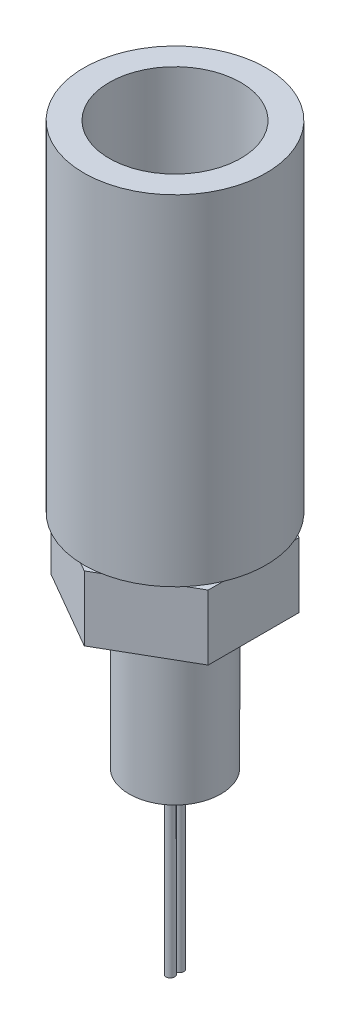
from build123d import *

# Parameters (mm, degrees)
EXTRUDE1_DEPTH  = 7.874
SKETCH3_R       = 7.875
EXTRUDE2_DEPTH  = 10.41
SKETCH4_R       = 0.955
EXTRUDE8_DEPTH  = 10.41
SKETCH_1_R      = 0.762
EXTRUDE9_DEPTH  = 10.41
SKETCH8_R       = 5.55625
EXTRUDE7_DEPTH  = 18.28030303
SKETCH9_R       = 0.89
SKETCH11_R      = 0.5207
EXTRUDE10_DEPTH = 21.43125


with BuildPart() as part:
    # Sketch1 → Extrude1 (new body)
    with BuildSketch(Plane(origin=(0, 0, 0), x_dir=(1, 0, 0), z_dir=(0, 1, 0))):
        Polygon((0, 10.998522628), (-9.525, 5.499261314), (-9.525, -5.499261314), (0, -10.998522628), (9.525, -5.499261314), (9.525, 5.499261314), align=None)
    extrude(amount=EXTRUDE1_DEPTH)

    # Sketch2 → Revolve1 (revolve)
    with BuildSketch(Plane.XY, mode=Mode.PRIVATE) as revolve1_sk:
        Polygon((8.8011, 7.874), (8.8011, 11.6586), (9.398, 11.6586), (9.398, 13.2334), (8.8011, 13.2334), (8.8011, 14.8844), (9.398, 14.8844), (9.398, 16.4592), (8.8011, 16.4592), (8.8011, 17.272), (0, 17.272), (0, 7.874), align=None)
    revolve(revolve1_sk.sketch.rotate(Axis((0, 0, 0), (0, -1, 0)), 180), axis=Axis((0, 0, 0), (0, -1, 0)))

    # Sketch3 → Extrude2 (add)
    with BuildSketch(Plane(origin=(0, 17.272, 0), x_dir=(-1, 0, 0), z_dir=(0, 1, 0))):
        with Locations(Location((0, 0, 0), (0, 0, 180))):
            Circle(SKETCH3_R)
    extrude(amount=EXTRUDE2_DEPTH)

    # Sketch4 → Extrude8 (cut)
    with BuildSketch(Plane(origin=(0, 27.682, 0), x_dir=(-1, 0, 0), z_dir=(0, 1, 0))):
        with Locations((-4.318, 0)):
            Circle(SKETCH4_R)
        with Locations((4.318, 0)):
            Circle(SKETCH4_R)
    extrude(amount=-EXTRUDE8_DEPTH, mode=Mode.SUBTRACT)

    # Sketch 1 → Extrude9 (cut)
    with BuildSketch(Plane(origin=(0.09953018, 27.682, 4.480198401), x_dir=(-1, 0, 0), z_dir=(0, 1, 0))):
        with Locations((0.09953018, -9.610998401)):
            Circle(SKETCH_1_R)
    extrude(amount=-EXTRUDE9_DEPTH, mode=Mode.SUBTRACT)

    # Sketch8 → Extrude7 (add)
    with BuildSketch(Plane.XZ):
        with Locations(Location((0, 0, 0), (0, 0, 90))):
            Circle(SKETCH8_R)
    extrude(amount=EXTRUDE7_DEPTH)

    # Sketch9 → o-ring 12.42x1.78 (revolve)
    with BuildSketch(Plane.XY, mode=Mode.PRIVATE) as o_ring_12_42x1_78_sk:
        with Locations((7.1, 0.284318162)):
            Circle(SKETCH9_R)
    revolve(o_ring_12_42x1_78_sk.sketch.rotate(Axis((0, 0, 0), (0, -1, 0)), 90), axis=Axis((0, 0, 0), (0, -1, 0)))

    # Sketch10 → Locking Sleeve (revolve)
    with BuildSketch(Plane.XY, mode=Mode.PRIVATE) as locking_sleeve_sk:
        Polygon((9.0805, 8.511893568), (9.0805, 11.5824), (9.944481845, 11.5824), (9.944481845, 13.2334), (9.0805, 13.2334), (9.0805, 14.7574), (9.944481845, 14.7574), (9.944481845, 19.003621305), (7.9756, 19.003621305), (7.9756, 49.659893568), (11.049, 49.659893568), (11.049, 8.511893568), align=None)
    revolve(locking_sleeve_sk.sketch.rotate(Axis((0, 0, 0), (0, 1, 0)), 90), axis=Axis((0, 0, 0), (0, 1, 0)))

    # Sketch11 → Extrude10 (add)
    with BuildSketch(Plane.XZ.offset(18.28030303)):
        with Locations(Location((0, 0.5588, 0), (0, 0, 270))):
            Circle(SKETCH11_R)
        with Locations(Location((0, -0.5588, 0), (0, 0, 270))):
            Circle(SKETCH11_R)
    extrude(amount=EXTRUDE10_DEPTH)


solid = part.part
